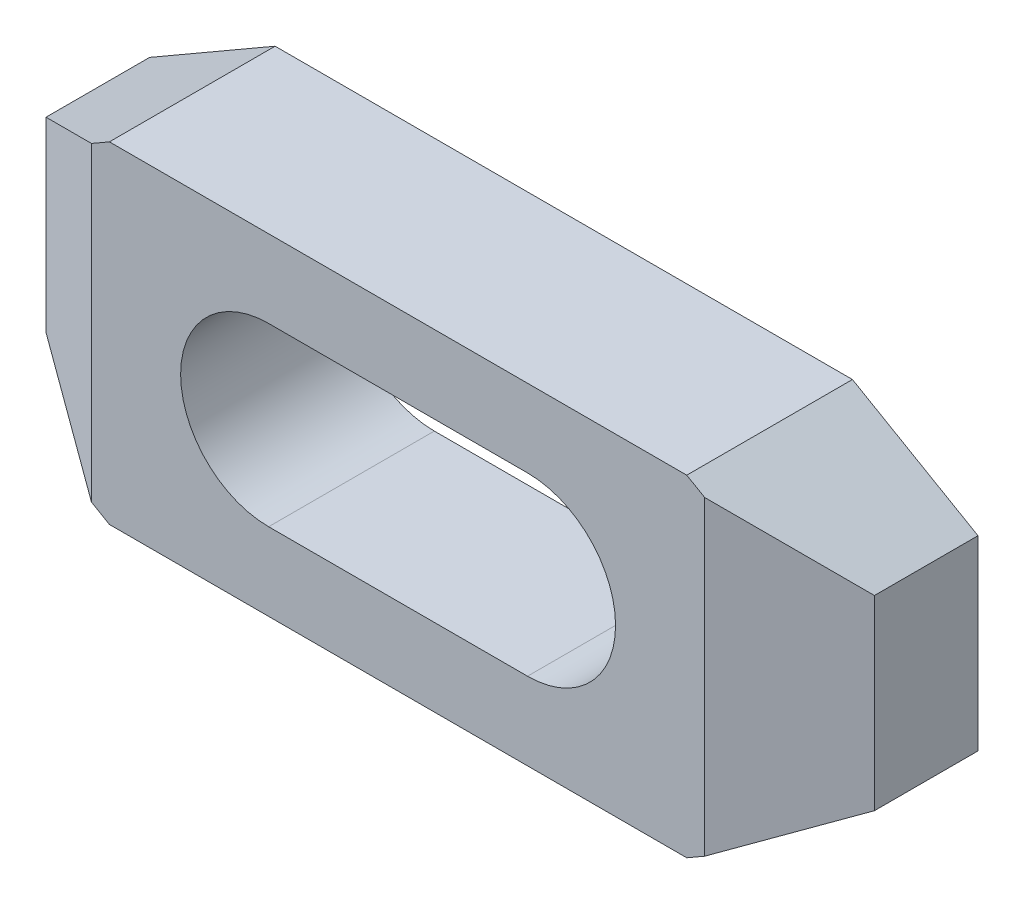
ISO-10303-21;
HEADER;
FILE_DESCRIPTION(('STEP AP214'),'2;1');
FILE_NAME('part.step','',(''),(''),'','','');
FILE_SCHEMA(('AUTOMOTIVE_DESIGN { 1 0 10303 214 1 1 1 1 }'));
ENDSEC;
DATA;
#1=APPLICATION_CONTEXT('core data for automotive mechanical design processes');
#2=APPLICATION_PROTOCOL_DEFINITION('international standard','automotive_design',2000,#1);
#3=PRODUCT_CONTEXT('',#1,'mechanical');
#4=PRODUCT('Part','Part','',(#3));
#5=PRODUCT_RELATED_PRODUCT_CATEGORY('part','',(#4));
#6=PRODUCT_DEFINITION_FORMATION('','',#4);
#7=PRODUCT_DEFINITION_CONTEXT('part definition',#1,'design');
#8=PRODUCT_DEFINITION('design','',#6,#7);
#9=PRODUCT_DEFINITION_SHAPE('','',#8);
#10=(LENGTH_UNIT() NAMED_UNIT(*) SI_UNIT(.MILLI.,.METRE.));
#11=(NAMED_UNIT(*) PLANE_ANGLE_UNIT() SI_UNIT($,.RADIAN.));
#12=(NAMED_UNIT(*) SI_UNIT($,.STERADIAN.) SOLID_ANGLE_UNIT());
#13=UNCERTAINTY_MEASURE_WITH_UNIT(LENGTH_MEASURE(1.E-05),#10,'distance_accuracy_value','');
#14=(GEOMETRIC_REPRESENTATION_CONTEXT(3) GLOBAL_UNCERTAINTY_ASSIGNED_CONTEXT((#13)) GLOBAL_UNIT_ASSIGNED_CONTEXT((#10,
#11,#12)) REPRESENTATION_CONTEXT('',''));
#15=CARTESIAN_POINT('',(0.,0.,0.));
#16=DIRECTION('',(0.,0.,1.));
#17=DIRECTION('',(1.,0.,0.));
#18=AXIS2_PLACEMENT_3D('',#15,#16,#17);
#19=CARTESIAN_POINT('',(0.,-32.0940107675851,16.));
#20=DIRECTION('',(0.,0.,-1.));
#21=DIRECTION('',(-1.,0.,0.));
#22=AXIS2_PLACEMENT_3D('',#19,#20,#21);
#23=PLANE('',#22);
#24=CARTESIAN_POINT('',(12.5,0.,16.));
#25=DIRECTION('',(0.,0.,1.));
#26=DIRECTION('',(1.,0.,0.));
#27=AXIS2_PLACEMENT_3D('',#24,#25,#26);
#28=CIRCLE('',#27,8.5);
#29=CARTESIAN_POINT('',(12.5,-8.5,16.));
#30=VERTEX_POINT('',#29);
#31=CARTESIAN_POINT('',(12.5,8.5,16.));
#32=VERTEX_POINT('',#31);
#33=EDGE_CURVE('E221',#30,#32,#28,.T.);
#34=ORIENTED_EDGE('',*,*,#33,.F.);
#35=DIRECTION('',(-1.,0.,0.));
#36=VECTOR('',#35,1.);
#37=CARTESIAN_POINT('',(12.5,-8.5,16.));
#38=LINE('',#37,#36);
#39=CARTESIAN_POINT('',(-12.5,-8.5,16.));
#40=VERTEX_POINT('',#39);
#41=EDGE_CURVE('E220',#30,#40,#38,.T.);
#42=ORIENTED_EDGE('',*,*,#41,.T.);
#43=CARTESIAN_POINT('',(-12.5,0.,16.));
#44=DIRECTION('',(0.,0.,1.));
#45=DIRECTION('',(1.,0.,0.));
#46=AXIS2_PLACEMENT_3D('',#43,#44,#45);
#47=CIRCLE('',#46,8.5);
#48=CARTESIAN_POINT('',(-12.5,8.5,16.));
#49=VERTEX_POINT('',#48);
#50=EDGE_CURVE('E228',#49,#40,#47,.T.);
#51=ORIENTED_EDGE('',*,*,#50,.F.);
#52=DIRECTION('',(-1.,0.,0.));
#53=VECTOR('',#52,1.);
#54=CARTESIAN_POINT('',(12.5,8.5,16.));
#55=LINE('',#54,#53);
#56=EDGE_CURVE('E224',#32,#49,#55,.T.);
#57=ORIENTED_EDGE('',*,*,#56,.F.);
#58=EDGE_LOOP('',(#34,#42,#51,#57));
#59=FACE_BOUND('',#58,.T.);
#60=DIRECTION('',(0.,1.,0.));
#61=VECTOR('',#60,1.);
#62=CARTESIAN_POINT('',(-29.6076951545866,-32.0940107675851,16.));
#63=LINE('',#62,#61);
#64=CARTESIAN_POINT('',(-29.6076951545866,-15.,16.));
#65=VERTEX_POINT('',#64);
#66=CARTESIAN_POINT('',(-29.6076951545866,15.,16.));
#67=VERTEX_POINT('',#66);
#68=EDGE_CURVE('E115',#65,#67,#63,.T.);
#69=ORIENTED_EDGE('',*,*,#68,.F.);
#70=DIRECTION('',(-0.866025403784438,0.5,0.));
#71=VECTOR('',#70,1.);
#72=CARTESIAN_POINT('',(-27.8756443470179,-16.,16.));
#73=LINE('',#72,#71);
#74=CARTESIAN_POINT('',(-27.8756443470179,-16.,16.));
#75=VERTEX_POINT('',#74);
#76=EDGE_CURVE('E174',#75,#65,#73,.T.);
#77=ORIENTED_EDGE('',*,*,#76,.F.);
#78=DIRECTION('',(-1.,0.,0.));
#79=VECTOR('',#78,1.);
#80=CARTESIAN_POINT('',(27.8756443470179,-16.,16.));
#81=LINE('',#80,#79);
#82=CARTESIAN_POINT('',(27.8756443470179,-16.,16.));
#83=VERTEX_POINT('',#82);
#84=EDGE_CURVE('E177',#83,#75,#81,.T.);
#85=ORIENTED_EDGE('',*,*,#84,.F.);
#86=DIRECTION('',(-0.866025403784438,-0.5,0.));
#87=VECTOR('',#86,1.);
#88=CARTESIAN_POINT('',(40.,-9.,16.));
#89=LINE('',#88,#87);
#90=CARTESIAN_POINT('',(29.6076951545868,-15.,16.));
#91=VERTEX_POINT('',#90);
#92=EDGE_CURVE('E157',#91,#83,#89,.T.);
#93=ORIENTED_EDGE('',*,*,#92,.F.);
#94=DIRECTION('',(0.,1.,0.));
#95=VECTOR('',#94,1.);
#96=CARTESIAN_POINT('',(29.6076951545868,-32.0940107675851,16.));
#97=LINE('',#96,#95);
#98=CARTESIAN_POINT('',(29.6076951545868,15.,16.));
#99=VERTEX_POINT('',#98);
#100=EDGE_CURVE('E146',#91,#99,#97,.T.);
#101=ORIENTED_EDGE('',*,*,#100,.T.);
#102=DIRECTION('',(0.866025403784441,-0.5,0.));
#103=VECTOR('',#102,1.);
#104=CARTESIAN_POINT('',(27.8756443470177,16.,16.));
#105=LINE('',#104,#103);
#106=CARTESIAN_POINT('',(27.8756443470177,16.,16.));
#107=VERTEX_POINT('',#106);
#108=EDGE_CURVE('E155',#107,#99,#105,.T.);
#109=ORIENTED_EDGE('',*,*,#108,.F.);
#110=DIRECTION('',(1.,0.,0.));
#111=VECTOR('',#110,1.);
#112=CARTESIAN_POINT('',(-27.8756443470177,16.,16.));
#113=LINE('',#112,#111);
#114=CARTESIAN_POINT('',(-27.8756443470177,16.,16.));
#115=VERTEX_POINT('',#114);
#116=EDGE_CURVE('E164',#115,#107,#113,.T.);
#117=ORIENTED_EDGE('',*,*,#116,.F.);
#118=DIRECTION('',(0.866025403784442,0.5,0.));
#119=VECTOR('',#118,1.);
#120=CARTESIAN_POINT('',(-40.,9.,16.));
#121=LINE('',#120,#119);
#122=EDGE_CURVE('E167',#67,#115,#121,.T.);
#123=ORIENTED_EDGE('',*,*,#122,.F.);
#124=EDGE_LOOP('',(#69,#77,#85,#93,#101,#109,#117,#123));
#125=FACE_BOUND('',#124,.T.);
#126=ADVANCED_FACE('F14',(#59,#125),#23,.F.);
#127=CARTESIAN_POINT('',(-40.,9.,16.));
#128=DIRECTION('',(-0.5,0.866025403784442,0.));
#129=DIRECTION('',(-0.866025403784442,-0.5,0.));
#130=AXIS2_PLACEMENT_3D('',#127,#128,#129);
#131=PLANE('',#130);
#132=DIRECTION('',(0.,0.,-1.));
#133=VECTOR('',#132,1.);
#134=CARTESIAN_POINT('',(-40.,9.,16.));
#135=LINE('',#134,#133);
#136=CARTESIAN_POINT('',(-40.,9.,10.));
#137=VERTEX_POINT('',#136);
#138=CARTESIAN_POINT('',(-40.,9.,0.));
#139=VERTEX_POINT('',#138);
#140=EDGE_CURVE('E124',#137,#139,#135,.T.);
#141=ORIENTED_EDGE('',*,*,#140,.F.);
#142=DIRECTION('',(0.774596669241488,0.447213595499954,0.447213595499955));
#143=VECTOR('',#142,1.);
#144=CARTESIAN_POINT('',(-37.9215390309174,10.2,11.2));
#145=LINE('',#144,#143);
#146=EDGE_CURVE('E112',#137,#67,#145,.T.);
#147=ORIENTED_EDGE('',*,*,#146,.T.);
#148=ORIENTED_EDGE('',*,*,#122,.T.);
#149=DIRECTION('',(0.,0.,-1.));
#150=VECTOR('',#149,1.);
#151=CARTESIAN_POINT('',(-27.8756443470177,16.,16.));
#152=LINE('',#151,#150);
#153=CARTESIAN_POINT('',(-27.8756443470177,16.,0.));
#154=VERTEX_POINT('',#153);
#155=EDGE_CURVE('E132',#115,#154,#152,.T.);
#156=ORIENTED_EDGE('',*,*,#155,.T.);
#157=DIRECTION('',(0.866025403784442,0.5,0.));
#158=VECTOR('',#157,1.);
#159=CARTESIAN_POINT('',(-40.,9.,0.));
#160=LINE('',#159,#158);
#161=EDGE_CURVE('E131',#139,#154,#160,.T.);
#162=ORIENTED_EDGE('',*,*,#161,.F.);
#163=EDGE_LOOP('',(#141,#147,#148,#156,#162));
#164=FACE_BOUND('',#163,.T.);
#165=ADVANCED_FACE('F129',(#164),#131,.T.);
#166=CARTESIAN_POINT('',(-40.,-9.,16.));
#167=DIRECTION('',(-1.,0.,0.));
#168=DIRECTION('',(0.,0.,1.));
#169=AXIS2_PLACEMENT_3D('',#166,#167,#168);
#170=PLANE('',#169);
#171=DIRECTION('',(0.,0.,-1.));
#172=VECTOR('',#171,1.);
#173=CARTESIAN_POINT('',(-40.,-9.,16.));
#174=LINE('',#173,#172);
#175=CARTESIAN_POINT('',(-40.,-9.,10.));
#176=VERTEX_POINT('',#175);
#177=CARTESIAN_POINT('',(-40.,-9.,0.));
#178=VERTEX_POINT('',#177);
#179=EDGE_CURVE('E126',#176,#178,#174,.T.);
#180=ORIENTED_EDGE('',*,*,#179,.F.);
#181=DIRECTION('',(0.,1.,0.));
#182=VECTOR('',#181,1.);
#183=CARTESIAN_POINT('',(-40.,-20.,10.));
#184=LINE('',#183,#182);
#185=EDGE_CURVE('E29',#176,#137,#184,.T.);
#186=ORIENTED_EDGE('',*,*,#185,.T.);
#187=ORIENTED_EDGE('',*,*,#140,.T.);
#188=DIRECTION('',(0.,1.,0.));
#189=VECTOR('',#188,1.);
#190=CARTESIAN_POINT('',(-40.,-9.,0.));
#191=LINE('',#190,#189);
#192=EDGE_CURVE('E199',#178,#139,#191,.T.);
#193=ORIENTED_EDGE('',*,*,#192,.F.);
#194=EDGE_LOOP('',(#180,#186,#187,#193));
#195=FACE_BOUND('',#194,.T.);
#196=ADVANCED_FACE('F122',(#195),#170,.T.);
#197=CARTESIAN_POINT('',(-27.8756443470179,-16.,16.));
#198=DIRECTION('',(-0.5,-0.866025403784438,0.));
#199=DIRECTION('',(0.866025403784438,-0.5,0.));
#200=AXIS2_PLACEMENT_3D('',#197,#198,#199);
#201=PLANE('',#200);
#202=ORIENTED_EDGE('',*,*,#76,.T.);
#203=DIRECTION('',(-0.774596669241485,0.447213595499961,-0.447213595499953));
#204=VECTOR('',#203,1.);
#205=CARTESIAN_POINT('',(-28.2220545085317,-15.8,16.8));
#206=LINE('',#205,#204);
#207=EDGE_CURVE('E9',#65,#176,#206,.T.);
#208=ORIENTED_EDGE('',*,*,#207,.T.);
#209=ORIENTED_EDGE('',*,*,#179,.T.);
#210=DIRECTION('',(-0.866025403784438,0.5,0.));
#211=VECTOR('',#210,1.);
#212=CARTESIAN_POINT('',(-27.8756443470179,-16.,0.));
#213=LINE('',#212,#211);
#214=CARTESIAN_POINT('',(-27.8756443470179,-16.,0.));
#215=VERTEX_POINT('',#214);
#216=EDGE_CURVE('E195',#215,#178,#213,.T.);
#217=ORIENTED_EDGE('',*,*,#216,.F.);
#218=DIRECTION('',(0.,0.,-1.));
#219=VECTOR('',#218,1.);
#220=CARTESIAN_POINT('',(-27.8756443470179,-16.,16.));
#221=LINE('',#220,#219);
#222=EDGE_CURVE('E136',#75,#215,#221,.T.);
#223=ORIENTED_EDGE('',*,*,#222,.F.);
#224=EDGE_LOOP('',(#202,#208,#209,#217,#223));
#225=FACE_BOUND('',#224,.T.);
#226=ADVANCED_FACE('F198',(#225),#201,.T.);
#227=CARTESIAN_POINT('',(0.,-32.0940107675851,0.));
#228=DIRECTION('',(0.,0.,-1.));
#229=DIRECTION('',(-1.,0.,0.));
#230=AXIS2_PLACEMENT_3D('',#227,#228,#229);
#231=PLANE('',#230);
#232=DIRECTION('',(-0.866025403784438,-0.5,0.));
#233=VECTOR('',#232,1.);
#234=CARTESIAN_POINT('',(40.,-9.,0.));
#235=LINE('',#234,#233);
#236=CARTESIAN_POINT('',(40.,-9.,0.));
#237=VERTEX_POINT('',#236);
#238=CARTESIAN_POINT('',(27.8756443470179,-16.,0.));
#239=VERTEX_POINT('',#238);
#240=EDGE_CURVE('E170',#237,#239,#235,.T.);
#241=ORIENTED_EDGE('',*,*,#240,.T.);
#242=DIRECTION('',(-1.,0.,0.));
#243=VECTOR('',#242,1.);
#244=CARTESIAN_POINT('',(27.8756443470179,-16.,0.));
#245=LINE('',#244,#243);
#246=EDGE_CURVE('E186',#239,#215,#245,.T.);
#247=ORIENTED_EDGE('',*,*,#246,.T.);
#248=ORIENTED_EDGE('',*,*,#216,.T.);
#249=ORIENTED_EDGE('',*,*,#192,.T.);
#250=ORIENTED_EDGE('',*,*,#161,.T.);
#251=DIRECTION('',(1.,0.,0.));
#252=VECTOR('',#251,1.);
#253=CARTESIAN_POINT('',(-27.8756443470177,16.,0.));
#254=LINE('',#253,#252);
#255=CARTESIAN_POINT('',(27.8756443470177,16.,0.));
#256=VERTEX_POINT('',#255);
#257=EDGE_CURVE('E204',#154,#256,#254,.T.);
#258=ORIENTED_EDGE('',*,*,#257,.T.);
#259=DIRECTION('',(0.866025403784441,-0.5,0.));
#260=VECTOR('',#259,1.);
#261=CARTESIAN_POINT('',(27.8756443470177,16.,0.));
#262=LINE('',#261,#260);
#263=CARTESIAN_POINT('',(40.,9.,0.));
#264=VERTEX_POINT('',#263);
#265=EDGE_CURVE('E207',#256,#264,#262,.T.);
#266=ORIENTED_EDGE('',*,*,#265,.T.);
#267=DIRECTION('',(0.,-1.,0.));
#268=VECTOR('',#267,1.);
#269=CARTESIAN_POINT('',(40.,9.,0.));
#270=LINE('',#269,#268);
#271=EDGE_CURVE('E180',#264,#237,#270,.T.);
#272=ORIENTED_EDGE('',*,*,#271,.T.);
#273=EDGE_LOOP('',(#241,#247,#248,#249,#250,#258,#266,#272));
#274=FACE_BOUND('',#273,.T.);
#275=DIRECTION('',(-1.,0.,0.));
#276=VECTOR('',#275,1.);
#277=CARTESIAN_POINT('',(12.5,-8.5,0.));
#278=LINE('',#277,#276);
#279=CARTESIAN_POINT('',(12.5,-8.5,0.));
#280=VERTEX_POINT('',#279);
#281=CARTESIAN_POINT('',(-12.5,-8.5,0.));
#282=VERTEX_POINT('',#281);
#283=EDGE_CURVE('E225',#280,#282,#278,.T.);
#284=ORIENTED_EDGE('',*,*,#283,.F.);
#285=CARTESIAN_POINT('',(12.5,0.,0.));
#286=DIRECTION('',(0.,0.,1.));
#287=DIRECTION('',(1.,0.,0.));
#288=AXIS2_PLACEMENT_3D('',#285,#286,#287);
#289=CIRCLE('',#288,8.5);
#290=CARTESIAN_POINT('',(12.5,8.5,0.));
#291=VERTEX_POINT('',#290);
#292=EDGE_CURVE('E232',#280,#291,#289,.T.);
#293=ORIENTED_EDGE('',*,*,#292,.T.);
#294=DIRECTION('',(-1.,0.,0.));
#295=VECTOR('',#294,1.);
#296=CARTESIAN_POINT('',(12.5,8.5,0.));
#297=LINE('',#296,#295);
#298=CARTESIAN_POINT('',(-12.5,8.5,0.));
#299=VERTEX_POINT('',#298);
#300=EDGE_CURVE('E235',#291,#299,#297,.T.);
#301=ORIENTED_EDGE('',*,*,#300,.T.);
#302=CARTESIAN_POINT('',(-12.5,0.,0.));
#303=DIRECTION('',(0.,0.,1.));
#304=DIRECTION('',(1.,0.,0.));
#305=AXIS2_PLACEMENT_3D('',#302,#303,#304);
#306=CIRCLE('',#305,8.5);
#307=EDGE_CURVE('E238',#299,#282,#306,.T.);
#308=ORIENTED_EDGE('',*,*,#307,.T.);
#309=EDGE_LOOP('',(#284,#293,#301,#308));
#310=FACE_BOUND('',#309,.T.);
#311=ADVANCED_FACE('F193',(#274,#310),#231,.T.);
#312=CARTESIAN_POINT('',(40.,-9.,16.));
#313=DIRECTION('',(0.5,-0.866025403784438,0.));
#314=DIRECTION('',(0.866025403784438,0.5,0.));
#315=AXIS2_PLACEMENT_3D('',#312,#313,#314);
#316=PLANE('',#315);
#317=DIRECTION('',(0.774596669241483,0.447213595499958,-0.447213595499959));
#318=VECTOR('',#317,1.);
#319=CARTESIAN_POINT('',(37.9215390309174,-10.2,11.2));
#320=LINE('',#319,#318);
#321=CARTESIAN_POINT('',(40.,-9.,10.));
#322=VERTEX_POINT('',#321);
#323=EDGE_CURVE('E158',#91,#322,#320,.T.);
#324=ORIENTED_EDGE('',*,*,#323,.F.);
#325=ORIENTED_EDGE('',*,*,#92,.T.);
#326=DIRECTION('',(0.,0.,-1.));
#327=VECTOR('',#326,1.);
#328=CARTESIAN_POINT('',(27.8756443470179,-16.,16.));
#329=LINE('',#328,#327);
#330=EDGE_CURVE('E163',#83,#239,#329,.T.);
#331=ORIENTED_EDGE('',*,*,#330,.T.);
#332=ORIENTED_EDGE('',*,*,#240,.F.);
#333=DIRECTION('',(0.,0.,-1.));
#334=VECTOR('',#333,1.);
#335=CARTESIAN_POINT('',(40.,-9.,16.));
#336=LINE('',#335,#334);
#337=EDGE_CURVE('E143',#322,#237,#336,.T.);
#338=ORIENTED_EDGE('',*,*,#337,.F.);
#339=EDGE_LOOP('',(#324,#325,#331,#332,#338));
#340=FACE_BOUND('',#339,.T.);
#341=ADVANCED_FACE('F249',(#340),#316,.T.);
#342=CARTESIAN_POINT('',(40.,9.,16.));
#343=DIRECTION('',(1.,0.,0.));
#344=DIRECTION('',(0.,1.,0.));
#345=AXIS2_PLACEMENT_3D('',#342,#343,#344);
#346=PLANE('',#345);
#347=DIRECTION('',(0.,1.,0.));
#348=VECTOR('',#347,1.);
#349=CARTESIAN_POINT('',(40.,-20.,10.));
#350=LINE('',#349,#348);
#351=CARTESIAN_POINT('',(40.,9.,10.));
#352=VERTEX_POINT('',#351);
#353=EDGE_CURVE('E36',#322,#352,#350,.T.);
#354=ORIENTED_EDGE('',*,*,#353,.F.);
#355=ORIENTED_EDGE('',*,*,#337,.T.);
#356=ORIENTED_EDGE('',*,*,#271,.F.);
#357=DIRECTION('',(0.,0.,-1.));
#358=VECTOR('',#357,1.);
#359=CARTESIAN_POINT('',(40.,9.,16.));
#360=LINE('',#359,#358);
#361=EDGE_CURVE('E141',#352,#264,#360,.T.);
#362=ORIENTED_EDGE('',*,*,#361,.F.);
#363=EDGE_LOOP('',(#354,#355,#356,#362));
#364=FACE_BOUND('',#363,.T.);
#365=ADVANCED_FACE('F16',(#364),#346,.T.);
#366=CARTESIAN_POINT('',(27.8756443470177,16.,16.));
#367=DIRECTION('',(0.5,0.866025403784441,0.));
#368=DIRECTION('',(-0.866025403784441,0.5,0.));
#369=AXIS2_PLACEMENT_3D('',#366,#367,#368);
#370=PLANE('',#369);
#371=DIRECTION('',(-0.774596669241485,0.447213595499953,0.44721359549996));
#372=VECTOR('',#371,1.);
#373=CARTESIAN_POINT('',(28.2220545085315,15.8,16.8));
#374=LINE('',#373,#372);
#375=EDGE_CURVE('E22',#352,#99,#374,.T.);
#376=ORIENTED_EDGE('',*,*,#375,.F.);
#377=ORIENTED_EDGE('',*,*,#361,.T.);
#378=ORIENTED_EDGE('',*,*,#265,.F.);
#379=DIRECTION('',(0.,0.,-1.));
#380=VECTOR('',#379,1.);
#381=CARTESIAN_POINT('',(27.8756443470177,16.,16.));
#382=LINE('',#381,#380);
#383=EDGE_CURVE('E134',#107,#256,#382,.T.);
#384=ORIENTED_EDGE('',*,*,#383,.F.);
#385=ORIENTED_EDGE('',*,*,#108,.T.);
#386=EDGE_LOOP('',(#376,#377,#378,#384,#385));
#387=FACE_BOUND('',#386,.T.);
#388=ADVANCED_FACE('F160',(#387),#370,.T.);
#389=CARTESIAN_POINT('',(-27.8756443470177,16.,16.));
#390=DIRECTION('',(0.,1.,0.));
#391=DIRECTION('',(0.,0.,1.));
#392=AXIS2_PLACEMENT_3D('',#389,#390,#391);
#393=PLANE('',#392);
#394=ORIENTED_EDGE('',*,*,#155,.F.);
#395=ORIENTED_EDGE('',*,*,#116,.T.);
#396=ORIENTED_EDGE('',*,*,#383,.T.);
#397=ORIENTED_EDGE('',*,*,#257,.F.);
#398=EDGE_LOOP('',(#394,#395,#396,#397));
#399=FACE_BOUND('',#398,.T.);
#400=ADVANCED_FACE('F253',(#399),#393,.T.);
#401=CARTESIAN_POINT('',(27.8756443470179,-16.,16.));
#402=DIRECTION('',(0.,-1.,0.));
#403=DIRECTION('',(1.,0.,0.));
#404=AXIS2_PLACEMENT_3D('',#401,#402,#403);
#405=PLANE('',#404);
#406=ORIENTED_EDGE('',*,*,#84,.T.);
#407=ORIENTED_EDGE('',*,*,#222,.T.);
#408=ORIENTED_EDGE('',*,*,#246,.F.);
#409=ORIENTED_EDGE('',*,*,#330,.F.);
#410=EDGE_LOOP('',(#406,#407,#408,#409));
#411=FACE_BOUND('',#410,.T.);
#412=ADVANCED_FACE('F184',(#411),#405,.T.);
#413=CARTESIAN_POINT('',(12.5,0.,16.));
#414=DIRECTION('',(0.,0.,-1.));
#415=DIRECTION('',(-1.,0.,0.));
#416=AXIS2_PLACEMENT_3D('',#413,#414,#415);
#417=CYLINDRICAL_SURFACE('',#416,8.5);
#418=DIRECTION('',(0.,0.,-1.));
#419=VECTOR('',#418,1.);
#420=CARTESIAN_POINT('',(12.5,8.5,16.));
#421=LINE('',#420,#419);
#422=EDGE_CURVE('E211',#32,#291,#421,.T.);
#423=ORIENTED_EDGE('',*,*,#422,.T.);
#424=ORIENTED_EDGE('',*,*,#292,.F.);
#425=DIRECTION('',(0.,0.,-1.));
#426=VECTOR('',#425,1.);
#427=CARTESIAN_POINT('',(12.5,-8.5,16.));
#428=LINE('',#427,#426);
#429=EDGE_CURVE('E217',#30,#280,#428,.T.);
#430=ORIENTED_EDGE('',*,*,#429,.F.);
#431=ORIENTED_EDGE('',*,*,#33,.T.);
#432=EDGE_LOOP('',(#423,#424,#430,#431));
#433=FACE_BOUND('',#432,.T.);
#434=ADVANCED_FACE('F261',(#433),#417,.F.);
#435=CARTESIAN_POINT('',(12.5,8.5,16.));
#436=DIRECTION('',(0.,-1.,0.));
#437=DIRECTION('',(1.,0.,0.));
#438=AXIS2_PLACEMENT_3D('',#435,#436,#437);
#439=PLANE('',#438);
#440=DIRECTION('',(0.,0.,-1.));
#441=VECTOR('',#440,1.);
#442=CARTESIAN_POINT('',(-12.5,8.5,16.));
#443=LINE('',#442,#441);
#444=EDGE_CURVE('E213',#49,#299,#443,.T.);
#445=ORIENTED_EDGE('',*,*,#444,.T.);
#446=ORIENTED_EDGE('',*,*,#300,.F.);
#447=ORIENTED_EDGE('',*,*,#422,.F.);
#448=ORIENTED_EDGE('',*,*,#56,.T.);
#449=EDGE_LOOP('',(#445,#446,#447,#448));
#450=FACE_BOUND('',#449,.T.);
#451=ADVANCED_FACE('F336',(#450),#439,.T.);
#452=CARTESIAN_POINT('',(-12.5,0.,16.));
#453=DIRECTION('',(0.,0.,-1.));
#454=DIRECTION('',(-1.,0.,0.));
#455=AXIS2_PLACEMENT_3D('',#452,#453,#454);
#456=CYLINDRICAL_SURFACE('',#455,8.5);
#457=DIRECTION('',(0.,0.,-1.));
#458=VECTOR('',#457,1.);
#459=CARTESIAN_POINT('',(-12.5,-8.5,16.));
#460=LINE('',#459,#458);
#461=EDGE_CURVE('E215',#40,#282,#460,.T.);
#462=ORIENTED_EDGE('',*,*,#461,.T.);
#463=ORIENTED_EDGE('',*,*,#307,.F.);
#464=ORIENTED_EDGE('',*,*,#444,.F.);
#465=ORIENTED_EDGE('',*,*,#50,.T.);
#466=EDGE_LOOP('',(#462,#463,#464,#465));
#467=FACE_BOUND('',#466,.T.);
#468=ADVANCED_FACE('F346',(#467),#456,.F.);
#469=CARTESIAN_POINT('',(12.5,-8.5,16.));
#470=DIRECTION('',(0.,-1.,0.));
#471=DIRECTION('',(1.,0.,0.));
#472=AXIS2_PLACEMENT_3D('',#469,#470,#471);
#473=PLANE('',#472);
#474=ORIENTED_EDGE('',*,*,#41,.F.);
#475=ORIENTED_EDGE('',*,*,#429,.T.);
#476=ORIENTED_EDGE('',*,*,#283,.T.);
#477=ORIENTED_EDGE('',*,*,#461,.F.);
#478=EDGE_LOOP('',(#474,#475,#476,#477));
#479=FACE_BOUND('',#478,.T.);
#480=ADVANCED_FACE('F355',(#479),#473,.F.);
#481=CARTESIAN_POINT('',(40.,-20.,10.));
#482=DIRECTION('',(-0.5,0.,-0.866025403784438));
#483=DIRECTION('',(-0.866025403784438,0.,0.5));
#484=AXIS2_PLACEMENT_3D('',#481,#482,#483);
#485=PLANE('',#484);
#486=ORIENTED_EDGE('',*,*,#323,.T.);
#487=ORIENTED_EDGE('',*,*,#353,.T.);
#488=ORIENTED_EDGE('',*,*,#375,.T.);
#489=ORIENTED_EDGE('',*,*,#100,.F.);
#490=EDGE_LOOP('',(#486,#487,#488,#489));
#491=FACE_BOUND('',#490,.T.);
#492=ADVANCED_FACE('F145',(#491),#485,.F.);
#493=CARTESIAN_POINT('',(-40.,-20.,10.));
#494=DIRECTION('',(-0.5,0.,0.866025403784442));
#495=DIRECTION('',(0.866025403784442,0.,0.5));
#496=AXIS2_PLACEMENT_3D('',#493,#494,#495);
#497=PLANE('',#496);
#498=ORIENTED_EDGE('',*,*,#185,.F.);
#499=ORIENTED_EDGE('',*,*,#207,.F.);
#500=ORIENTED_EDGE('',*,*,#68,.T.);
#501=ORIENTED_EDGE('',*,*,#146,.F.);
#502=EDGE_LOOP('',(#498,#499,#500,#501));
#503=FACE_BOUND('',#502,.T.);
#504=ADVANCED_FACE('F113',(#503),#497,.T.);
#505=CLOSED_SHELL('',(#126,#165,#196,#226,#311,#341,#365,#388,#400,#412,#434,#451,#468,#480,
#492,#504));
#506=MANIFOLD_SOLID_BREP('B1',#505);
#507=ADVANCED_BREP_SHAPE_REPRESENTATION('',(#18,#506),#14);
#508=SHAPE_DEFINITION_REPRESENTATION(#9,#507);
ENDSEC;
END-ISO-10303-21;
